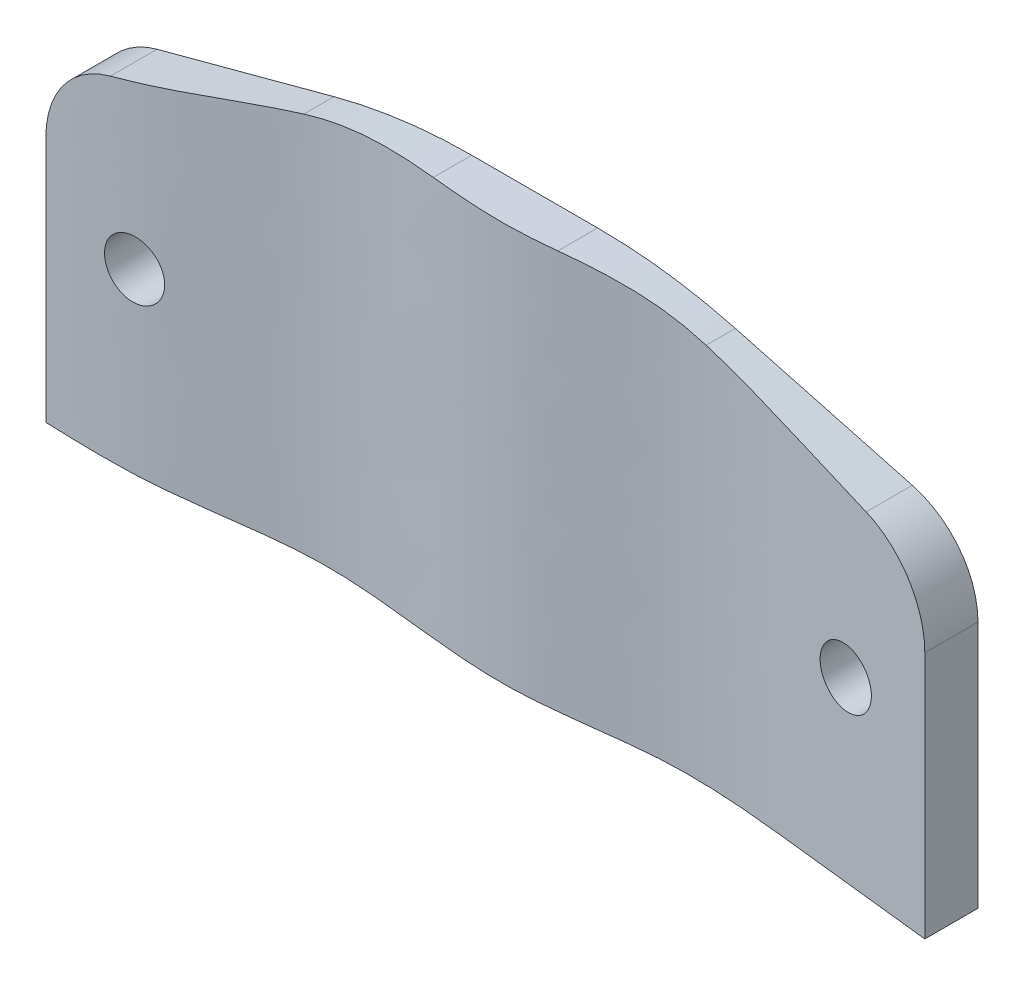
ISO-10303-21;
HEADER;
FILE_DESCRIPTION(('STEP AP214'),'2;1');
FILE_NAME('part.step','',(''),(''),'','','');
FILE_SCHEMA(('AUTOMOTIVE_DESIGN { 1 0 10303 214 1 1 1 1 }'));
ENDSEC;
DATA;
#1=APPLICATION_CONTEXT('core data for automotive mechanical design processes');
#2=APPLICATION_PROTOCOL_DEFINITION('international standard','automotive_design',2000,#1);
#3=PRODUCT_CONTEXT('',#1,'mechanical');
#4=PRODUCT('Part','Part','',(#3));
#5=PRODUCT_RELATED_PRODUCT_CATEGORY('part','',(#4));
#6=PRODUCT_DEFINITION_FORMATION('','',#4);
#7=PRODUCT_DEFINITION_CONTEXT('part definition',#1,'design');
#8=PRODUCT_DEFINITION('design','',#6,#7);
#9=PRODUCT_DEFINITION_SHAPE('','',#8);
#10=(LENGTH_UNIT() NAMED_UNIT(*) SI_UNIT(.MILLI.,.METRE.));
#11=(NAMED_UNIT(*) PLANE_ANGLE_UNIT() SI_UNIT($,.RADIAN.));
#12=(NAMED_UNIT(*) SI_UNIT($,.STERADIAN.) SOLID_ANGLE_UNIT());
#13=UNCERTAINTY_MEASURE_WITH_UNIT(LENGTH_MEASURE(1.E-05),#10,'distance_accuracy_value','');
#14=(GEOMETRIC_REPRESENTATION_CONTEXT(3) GLOBAL_UNCERTAINTY_ASSIGNED_CONTEXT((#13)) GLOBAL_UNIT_ASSIGNED_CONTEXT((#10,
#11,#12)) REPRESENTATION_CONTEXT('',''));
#15=CARTESIAN_POINT('',(0.,0.,0.));
#16=DIRECTION('',(0.,0.,1.));
#17=DIRECTION('',(1.,0.,0.));
#18=AXIS2_PLACEMENT_3D('',#15,#16,#17);
#19=CARTESIAN_POINT('',(-50.,27.948508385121,6.));
#20=DIRECTION('',(1.,0.,0.));
#21=DIRECTION('',(0.,0.,-1.));
#22=AXIS2_PLACEMENT_3D('',#19,#20,#21);
#23=PLANE('',#22);
#24=DIRECTION('',(0.,-1.,0.));
#25=VECTOR('',#24,1.);
#26=CARTESIAN_POINT('',(-50.,45.,5.11008461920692));
#27=LINE('',#26,#25);
#28=CARTESIAN_POINT('',(-50.,27.948508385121,5.11008461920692));
#29=VERTEX_POINT('',#28);
#30=CARTESIAN_POINT('',(-49.9999999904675,0.,5.11008461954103));
#31=VERTEX_POINT('',#30);
#32=EDGE_CURVE('E431',#29,#31,#27,.T.);
#33=ORIENTED_EDGE('',*,*,#32,.F.);
#34=DIRECTION('',(0.,0.,-1.));
#35=VECTOR('',#34,1.);
#36=CARTESIAN_POINT('',(-50.,27.948508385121,6.));
#37=LINE('',#36,#35);
#38=CARTESIAN_POINT('',(-50.,27.948508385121,0.));
#39=VERTEX_POINT('',#38);
#40=EDGE_CURVE('E372',#29,#39,#37,.T.);
#41=ORIENTED_EDGE('',*,*,#40,.T.);
#42=DIRECTION('',(0.,-1.,0.));
#43=VECTOR('',#42,1.);
#44=CARTESIAN_POINT('',(-50.,27.948508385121,0.));
#45=LINE('',#44,#43);
#46=CARTESIAN_POINT('',(-50.,0.,0.));
#47=VERTEX_POINT('',#46);
#48=EDGE_CURVE('E498',#39,#47,#45,.T.);
#49=ORIENTED_EDGE('',*,*,#48,.T.);
#50=DIRECTION('',(0.,0.,-1.));
#51=VECTOR('',#50,1.);
#52=CARTESIAN_POINT('',(-50.,0.,6.));
#53=LINE('',#52,#51);
#54=EDGE_CURVE('E11',#31,#47,#53,.T.);
#55=ORIENTED_EDGE('',*,*,#54,.F.);
#56=EDGE_LOOP('',(#33,#41,#49,#55));
#57=FACE_BOUND('',#56,.T.);
#58=ADVANCED_FACE('F348',(#57),#23,.F.);
#59=CARTESIAN_POINT('',(50.,0.,6.));
#60=DIRECTION('',(0.,1.,0.));
#61=DIRECTION('',(-1.,0.,0.));
#62=AXIS2_PLACEMENT_3D('',#59,#60,#61);
#63=PLANE('',#62);
#64=CARTESIAN_POINT('',(50.,0.,6.));
#65=CARTESIAN_POINT('',(45.1556419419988,0.,5.48204232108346));
#66=CARTESIAN_POINT('',(34.5204143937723,0.,4.34492617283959));
#67=CARTESIAN_POINT('',(18.5667341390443,0.,2.39851787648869));
#68=CARTESIAN_POINT('',(-0.203774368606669,0.,6.29787561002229));
#69=CARTESIAN_POINT('',(-18.9865250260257,0.,1.79013938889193));
#70=CARTESIAN_POINT('',(-36.6115833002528,0.,5.58536599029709));
#71=CARTESIAN_POINT('',(-46.5621686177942,0.,5.23221555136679));
#72=CARTESIAN_POINT('',(-50.822861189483,0.,5.08100178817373));
#73=B_SPLINE_CURVE_WITH_KNOTS('',3,(#64,#65,#66,#67,#68,#69,#70,#71,#72),.UNSPECIFIED.,.F.,.F.,
(4,1,1,1,1,1,4),(0.,0.144711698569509,0.31769778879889,0.472710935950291,0.705300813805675,
0.873814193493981,1.),.UNSPECIFIED.);
#74=CARTESIAN_POINT('',(50.,0.,6.));
#75=VERTEX_POINT('',#74);
#76=EDGE_CURVE('E425',#75,#31,#73,.T.);
#77=ORIENTED_EDGE('',*,*,#76,.T.);
#78=ORIENTED_EDGE('',*,*,#54,.T.);
#79=DIRECTION('',(1.,0.,0.));
#80=VECTOR('',#79,1.);
#81=CARTESIAN_POINT('',(50.,0.,0.));
#82=LINE('',#81,#80);
#83=CARTESIAN_POINT('',(50.,0.,0.));
#84=VERTEX_POINT('',#83);
#85=EDGE_CURVE('E439',#47,#84,#82,.T.);
#86=ORIENTED_EDGE('',*,*,#85,.T.);
#87=DIRECTION('',(0.,0.,-1.));
#88=VECTOR('',#87,1.);
#89=CARTESIAN_POINT('',(50.,0.,6.));
#90=LINE('',#89,#88);
#91=EDGE_CURVE('E356',#75,#84,#90,.T.);
#92=ORIENTED_EDGE('',*,*,#91,.F.);
#93=EDGE_LOOP('',(#77,#78,#86,#92));
#94=FACE_BOUND('',#93,.T.);
#95=ADVANCED_FACE('F437',(#94),#63,.F.);
#96=CARTESIAN_POINT('',(40.,27.9485083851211,6.));
#97=DIRECTION('',(0.,0.,-1.));
#98=DIRECTION('',(-1.,0.,0.));
#99=AXIS2_PLACEMENT_3D('',#96,#97,#98);
#100=CYLINDRICAL_SURFACE('',#99,10.);
#101=CARTESIAN_POINT('',(50.,27.948508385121,6.));
#102=CARTESIAN_POINT('',(50.0000310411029,28.2285690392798,6.00000330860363));
#103=CARTESIAN_POINT('',(49.9882362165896,28.5086247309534,5.99874221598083));
#104=CARTESIAN_POINT('',(49.9412193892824,29.066724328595,5.99371519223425));
#105=CARTESIAN_POINT('',(49.9059987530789,29.3447683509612,5.98994940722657));
#106=CARTESIAN_POINT('',(49.8123841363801,29.8967029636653,5.97994009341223));
#107=CARTESIAN_POINT('',(49.7540046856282,30.1705960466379,5.97369811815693));
#108=CARTESIAN_POINT('',(49.6145115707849,30.7124590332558,5.95878309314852));
#109=CARTESIAN_POINT('',(49.5333981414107,30.9804289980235,5.95011006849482));
#110=CARTESIAN_POINT('',(49.3489956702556,31.5086438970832,5.93039191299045));
#111=CARTESIAN_POINT('',(49.2456987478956,31.7688860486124,5.91934593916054));
#112=CARTESIAN_POINT('',(49.017699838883,32.2797116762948,5.89496271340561));
#113=CARTESIAN_POINT('',(48.8929974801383,32.530294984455,5.88162542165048));
#114=CARTESIAN_POINT('',(48.623136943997,33.0199613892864,5.85275834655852));
#115=CARTESIAN_POINT('',(48.4779849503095,33.2590479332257,5.83722922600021));
#116=CARTESIAN_POINT('',(48.1682488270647,33.7241269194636,5.80408375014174));
#117=CARTESIAN_POINT('',(48.0036648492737,33.9501194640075,5.78646741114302));
#118=CARTESIAN_POINT('',(47.6558468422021,34.3879460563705,5.74922508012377));
#119=CARTESIAN_POINT('',(47.4725705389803,34.599746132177,5.72959453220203));
#120=CARTESIAN_POINT('',(47.0889201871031,35.0072300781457,5.68848170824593));
#121=CARTESIAN_POINT('',(46.8885386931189,35.202906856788,5.66699862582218));
#122=CARTESIAN_POINT('',(46.4721279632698,35.5767369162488,5.62232563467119));
#123=CARTESIAN_POINT('',(46.2560944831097,35.7548854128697,5.59913526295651));
#124=CARTESIAN_POINT('',(45.8100661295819,36.0922965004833,5.55121591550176));
#125=CARTESIAN_POINT('',(45.5800779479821,36.2515680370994,5.52648767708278));
#126=CARTESIAN_POINT('',(45.1309554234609,36.5355203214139,5.47814846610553));
#127=CARTESIAN_POINT('',(44.9129809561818,36.6620627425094,5.45466709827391));
#128=CARTESIAN_POINT('',(44.4682006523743,36.8982898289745,5.4067004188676));
#129=CARTESIAN_POINT('',(44.2413954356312,37.007975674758,5.38221517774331));
#130=CARTESIAN_POINT('',(43.780371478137,37.2098286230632,5.33238080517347));
#131=CARTESIAN_POINT('',(43.5461571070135,37.302005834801,5.30703218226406));
#132=CARTESIAN_POINT('',(43.0715038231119,37.4684463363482,5.25558634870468));
#133=CARTESIAN_POINT('',(42.8310643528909,37.5427080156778,5.22948907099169));
#134=CARTESIAN_POINT('',(42.5881904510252,37.6077666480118,5.20308412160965));
#135=B_SPLINE_CURVE_WITH_KNOTS('',3,(#101,#102,#103,#104,#105,#106,#107,#108,#109,#110,#111,
#112,#113,#114,#115,#116,#117,#118,#119,#120,#121,#122,#123,#124,#125,#126,#127,#128,#129,#130,
#131,#132,#133,#134),.UNSPECIFIED.,.F.,.F.,(4,2,2,2,2,2,2,2,2,2,2,2,2,2,2,2,4),(0.,
0.839923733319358,1.67979847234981,2.51914710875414,3.3584870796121,4.19812571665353,
5.03777895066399,5.87717882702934,6.71657214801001,7.55790777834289,8.39961150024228,
9.24154432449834,10.0830765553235,10.8417770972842,11.6004244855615,12.3586325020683,
13.1169086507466),.UNSPECIFIED.);
#136=CARTESIAN_POINT('',(50.,27.9485083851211,6.));
#137=VERTEX_POINT('',#136);
#138=CARTESIAN_POINT('',(42.5881904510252,37.6077666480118,5.20308412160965));
#139=VERTEX_POINT('',#138);
#140=EDGE_CURVE('E506',#137,#139,#135,.T.);
#141=ORIENTED_EDGE('',*,*,#140,.F.);
#142=DIRECTION('',(0.,0.,-1.));
#143=VECTOR('',#142,1.);
#144=CARTESIAN_POINT('',(50.,27.948508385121,6.));
#145=LINE('',#144,#143);
#146=CARTESIAN_POINT('',(50.,27.948508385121,0.));
#147=VERTEX_POINT('',#146);
#148=EDGE_CURVE('E442',#137,#147,#145,.T.);
#149=ORIENTED_EDGE('',*,*,#148,.T.);
#150=CARTESIAN_POINT('',(40.,27.9485083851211,0.));
#151=DIRECTION('',(0.,0.,1.));
#152=DIRECTION('',(1.,0.,0.));
#153=AXIS2_PLACEMENT_3D('',#150,#151,#152);
#154=CIRCLE('',#153,10.);
#155=CARTESIAN_POINT('',(42.5881904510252,37.6077666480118,0.));
#156=VERTEX_POINT('',#155);
#157=EDGE_CURVE('E493',#147,#156,#154,.T.);
#158=ORIENTED_EDGE('',*,*,#157,.T.);
#159=DIRECTION('',(0.,0.,-1.));
#160=VECTOR('',#159,1.);
#161=CARTESIAN_POINT('',(42.5881904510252,37.6077666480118,6.));
#162=LINE('',#161,#160);
#163=EDGE_CURVE('E461',#139,#156,#162,.T.);
#164=ORIENTED_EDGE('',*,*,#163,.F.);
#165=EDGE_LOOP('',(#141,#149,#158,#164));
#166=FACE_BOUND('',#165,.T.);
#167=ADVANCED_FACE('F514',(#166),#100,.T.);
#168=CARTESIAN_POINT('',(22.6299928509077,42.955549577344,6.));
#169=DIRECTION('',(-0.258819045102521,-0.965925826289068,0.));
#170=DIRECTION('',(0.965925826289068,-0.258819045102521,0.));
#171=AXIS2_PLACEMENT_3D('',#168,#169,#170);
#172=PLANE('',#171);
#173=CARTESIAN_POINT('',(42.5881904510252,37.6077666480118,5.20308412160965));
#174=CARTESIAN_POINT('',(41.9235272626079,37.7858626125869,5.13082355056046));
#175=CARTESIAN_POINT('',(41.2588961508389,37.96394998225,5.05824429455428));
#176=CARTESIAN_POINT('',(39.9297795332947,38.3200857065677,4.91228864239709));
#177=CARTESIAN_POINT('',(39.2652940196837,38.498134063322,4.83891232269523));
#178=CARTESIAN_POINT('',(38.2686723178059,38.7651780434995,4.72812335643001));
#179=CARTESIAN_POINT('',(37.9364983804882,38.8541837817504,4.69107470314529));
#180=CARTESIAN_POINT('',(37.2721782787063,39.0321878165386,4.61671206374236));
#181=CARTESIAN_POINT('',(36.9400321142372,39.1211861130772,4.57939807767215));
#182=CARTESIAN_POINT('',(36.275799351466,39.2991667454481,4.50449580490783));
#183=CARTESIAN_POINT('',(35.9437127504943,39.3881490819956,4.46690754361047));
#184=CARTESIAN_POINT('',(35.2795744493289,39.5661044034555,4.39140163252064));
#185=CARTESIAN_POINT('',(34.9475227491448,39.6550773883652,4.35348398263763));
#186=CARTESIAN_POINT('',(34.2834496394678,39.8330152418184,4.27765864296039));
#187=CARTESIAN_POINT('',(33.9514282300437,39.9219801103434,4.23975095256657));
#188=CARTESIAN_POINT('',(33.2873423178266,40.0999213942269,4.16434341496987));
#189=CARTESIAN_POINT('',(32.9552778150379,40.1888978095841,4.12684356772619));
#190=CARTESIAN_POINT('',(31.9587095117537,40.4559274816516,4.01550376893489));
#191=CARTESIAN_POINT('',(31.2940800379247,40.63401441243,3.94285259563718));
#192=CARTESIAN_POINT('',(29.9642753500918,40.9903345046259,3.80384267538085));
#193=CARTESIAN_POINT('',(29.2991002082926,41.1685676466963,3.73748319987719));
#194=CARTESIAN_POINT('',(27.967966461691,41.525243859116,3.61419442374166));
#195=CARTESIAN_POINT('',(27.3020079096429,41.7036869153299,3.55726452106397));
#196=CARTESIAN_POINT('',(25.9690509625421,42.060851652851,3.45600892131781));
#197=CARTESIAN_POINT('',(25.3020524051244,42.2395733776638,3.41168544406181));
#198=CARTESIAN_POINT('',(23.9668119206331,42.5973499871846,3.33888047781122));
#199=CARTESIAN_POINT('',(23.2985694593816,42.7764050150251,3.31040964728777));
#200=CARTESIAN_POINT('',(22.6299928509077,42.955549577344,3.29151039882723));
#201=B_SPLINE_CURVE_WITH_KNOTS('',3,(#173,#174,#175,#176,#177,#178,#179,#180,#181,#182,#183,
#184,#185,#186,#187,#188,#189,#190,#191,#192,#193,#194,#195,#196,#197,#198,#199,#200),
.UNSPECIFIED.,.F.,.F.,(4,2,2,2,2,2,2,2,2,2,2,2,2,4),(0.,2.07568148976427,4.15116562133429,
5.18881061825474,6.22645542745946,7.26400534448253,8.30155554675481,9.33900880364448,
10.3764619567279,12.4521468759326,14.5275911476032,16.6029028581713,18.6785797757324,
20.7556505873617),.UNSPECIFIED.);
#202=CARTESIAN_POINT('',(22.6299928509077,42.955549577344,3.29151039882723));
#203=VERTEX_POINT('',#202);
#204=EDGE_CURVE('E583',#139,#203,#201,.T.);
#205=ORIENTED_EDGE('',*,*,#204,.F.);
#206=ORIENTED_EDGE('',*,*,#163,.T.);
#207=DIRECTION('',(-0.965925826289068,0.258819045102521,0.));
#208=VECTOR('',#207,1.);
#209=CARTESIAN_POINT('',(22.6299928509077,42.955549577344,0.));
#210=LINE('',#209,#208);
#211=CARTESIAN_POINT('',(22.6299928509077,42.955549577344,0.));
#212=VERTEX_POINT('',#211);
#213=EDGE_CURVE('E491',#156,#212,#210,.T.);
#214=ORIENTED_EDGE('',*,*,#213,.T.);
#215=DIRECTION('',(0.,0.,-1.));
#216=VECTOR('',#215,1.);
#217=CARTESIAN_POINT('',(22.6299928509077,42.955549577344,6.));
#218=LINE('',#217,#216);
#219=EDGE_CURVE('E465',#203,#212,#218,.T.);
#220=ORIENTED_EDGE('',*,*,#219,.F.);
#221=EDGE_LOOP('',(#205,#206,#214,#220));
#222=FACE_BOUND('',#221,.T.);
#223=ADVANCED_FACE('F591',(#222),#172,.F.);
#224=CARTESIAN_POINT('',(7.10085014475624,-15.,6.));
#225=DIRECTION('',(0.,0.,-1.));
#226=DIRECTION('',(-1.,0.,0.));
#227=AXIS2_PLACEMENT_3D('',#224,#225,#226);
#228=CYLINDRICAL_SURFACE('',#227,60.);
#229=CARTESIAN_POINT('',(22.6299928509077,42.955549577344,3.29151039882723));
#230=CARTESIAN_POINT('',(22.2041215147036,43.0696658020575,3.2794748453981));
#231=CARTESIAN_POINT('',(21.7768543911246,43.1791163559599,3.27129152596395));
#232=CARTESIAN_POINT('',(20.9215550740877,43.3881928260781,3.26364637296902));
#233=CARTESIAN_POINT('',(20.4935318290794,43.4878542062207,3.26415179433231));
#234=CARTESIAN_POINT('',(19.8506528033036,43.6301162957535,3.27212686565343));
#235=CARTESIAN_POINT('',(19.6365311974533,43.6762700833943,3.27597722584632));
#236=CARTESIAN_POINT('',(19.2078514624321,43.7662188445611,3.28619690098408));
#237=CARTESIAN_POINT('',(18.9932933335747,43.8100138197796,3.29256621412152));
#238=CARTESIAN_POINT('',(18.5642192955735,43.895151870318,3.3079214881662));
#239=CARTESIAN_POINT('',(18.3497041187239,43.9364995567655,3.31690232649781));
#240=CARTESIAN_POINT('',(17.9203649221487,44.0168263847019,3.33763767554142));
#241=CARTESIAN_POINT('',(17.7055409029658,44.055805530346,3.34939218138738));
#242=CARTESIAN_POINT('',(17.2758346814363,44.1313557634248,3.37549815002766));
#243=CARTESIAN_POINT('',(17.0609527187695,44.1679290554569,3.38984718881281));
#244=CARTESIAN_POINT('',(16.6309698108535,44.2387060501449,3.42089398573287));
#245=CARTESIAN_POINT('',(16.4158688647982,44.2729097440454,3.4375917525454));
#246=CARTESIAN_POINT('',(15.770347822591,44.3719575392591,3.49084885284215));
#247=CARTESIAN_POINT('',(15.3396376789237,44.4332509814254,3.53057651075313));
#248=CARTESIAN_POINT('',(14.478272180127,44.546301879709,3.61646093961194));
#249=CARTESIAN_POINT('',(14.0476176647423,44.5980731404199,3.66260823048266));
#250=CARTESIAN_POINT('',(13.1853772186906,44.6922674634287,3.75945836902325));
#251=CARTESIAN_POINT('',(12.7537907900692,44.7346814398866,3.81016557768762));
#252=CARTESIAN_POINT('',(11.8894585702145,44.8101806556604,3.91419067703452));
#253=CARTESIAN_POINT('',(11.4567120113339,44.8432517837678,3.96751237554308));
#254=CARTESIAN_POINT('',(10.5898233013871,44.9000510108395,4.07479453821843));
#255=CARTESIAN_POINT('',(10.1556800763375,44.9237607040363,4.12875604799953));
#256=CARTESIAN_POINT('',(9.28575222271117,44.9617897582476,4.23531064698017));
#257=CARTESIAN_POINT('',(8.84996615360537,44.9760864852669,4.28790014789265));
#258=CARTESIAN_POINT('',(7.97651186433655,44.9952040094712,4.38965165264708));
#259=CARTESIAN_POINT('',(7.5388418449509,44.9999972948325,4.43880330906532));
#260=CARTESIAN_POINT('',(7.10085014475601,45.,4.48511280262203));
#261=B_SPLINE_CURVE_WITH_KNOTS('',3,(#229,#230,#231,#232,#233,#234,#235,#236,#237,#238,#239,
#240,#241,#242,#243,#244,#245,#246,#247,#248,#249,#250,#251,#252,#253,#254,#255,#256,#257,#258,
#259,#260),.UNSPECIFIED.,.F.,.F.,(4,2,2,2,2,2,2,2,2,2,2,2,2,2,2,4),(0.,1.32319585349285,
2.64140610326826,3.29860192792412,3.95579728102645,4.611712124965,5.26762581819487,
5.92292984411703,6.57823629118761,7.88863001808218,9.19710879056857,10.5068525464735,
11.8185640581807,13.1328418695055,14.4502685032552,15.7715034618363),.UNSPECIFIED.);
#262=CARTESIAN_POINT('',(7.10085014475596,45.,4.48511280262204));
#263=VERTEX_POINT('',#262);
#264=EDGE_CURVE('E578',#203,#263,#261,.T.);
#265=ORIENTED_EDGE('',*,*,#264,.F.);
#266=ORIENTED_EDGE('',*,*,#219,.T.);
#267=CARTESIAN_POINT('',(7.10085014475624,-15.,0.));
#268=DIRECTION('',(0.,0.,1.));
#269=DIRECTION('',(1.,0.,0.));
#270=AXIS2_PLACEMENT_3D('',#267,#268,#269);
#271=CIRCLE('',#270,60.);
#272=CARTESIAN_POINT('',(7.100850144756,45.,0.));
#273=VERTEX_POINT('',#272);
#274=EDGE_CURVE('E488',#212,#273,#271,.T.);
#275=ORIENTED_EDGE('',*,*,#274,.T.);
#276=DIRECTION('',(0.,0.,-1.));
#277=VECTOR('',#276,1.);
#278=CARTESIAN_POINT('',(7.100850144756,45.,6.));
#279=LINE('',#278,#277);
#280=EDGE_CURVE('E471',#263,#273,#279,.T.);
#281=ORIENTED_EDGE('',*,*,#280,.F.);
#282=EDGE_LOOP('',(#265,#266,#275,#281));
#283=FACE_BOUND('',#282,.T.);
#284=ADVANCED_FACE('F587',(#283),#228,.T.);
#285=CARTESIAN_POINT('',(-7.10085014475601,45.,6.));
#286=DIRECTION('',(0.,-1.,0.));
#287=DIRECTION('',(1.,0.,0.));
#288=AXIS2_PLACEMENT_3D('',#285,#286,#287);
#289=PLANE('',#288);
#290=CARTESIAN_POINT('',(50.,45.,6.));
#291=CARTESIAN_POINT('',(45.1556419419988,45.,5.48204232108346));
#292=CARTESIAN_POINT('',(34.5204143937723,45.,4.34492617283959));
#293=CARTESIAN_POINT('',(18.5667341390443,45.,2.39851787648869));
#294=CARTESIAN_POINT('',(-0.203774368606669,45.,6.29787561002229));
#295=CARTESIAN_POINT('',(-18.9865250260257,45.,1.79013938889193));
#296=CARTESIAN_POINT('',(-36.6115833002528,45.,5.58536599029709));
#297=CARTESIAN_POINT('',(-46.5621686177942,45.,5.23221555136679));
#298=CARTESIAN_POINT('',(-50.822861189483,45.,5.08100178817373));
#299=B_SPLINE_CURVE_WITH_KNOTS('',3,(#290,#291,#292,#293,#294,#295,#296,#297,#298),
.UNSPECIFIED.,.F.,.F.,(4,1,1,1,1,1,4),(0.,0.144711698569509,0.31769778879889,0.472710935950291,
0.705300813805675,0.873814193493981,1.),.UNSPECIFIED.);
#300=CARTESIAN_POINT('',(-7.10085014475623,45.,4.33370743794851));
#301=VERTEX_POINT('',#300);
#302=EDGE_CURVE('E434',#263,#301,#299,.T.);
#303=ORIENTED_EDGE('',*,*,#302,.F.);
#304=ORIENTED_EDGE('',*,*,#280,.T.);
#305=DIRECTION('',(-1.,0.,0.));
#306=VECTOR('',#305,1.);
#307=CARTESIAN_POINT('',(-7.10085014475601,45.,0.));
#308=LINE('',#307,#306);
#309=CARTESIAN_POINT('',(-7.10085014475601,45.,0.));
#310=VERTEX_POINT('',#309);
#311=EDGE_CURVE('E485',#273,#310,#308,.T.);
#312=ORIENTED_EDGE('',*,*,#311,.T.);
#313=DIRECTION('',(0.,0.,-1.));
#314=VECTOR('',#313,1.);
#315=CARTESIAN_POINT('',(-7.10085014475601,45.,6.));
#316=LINE('',#315,#314);
#317=EDGE_CURVE('E475',#301,#310,#316,.T.);
#318=ORIENTED_EDGE('',*,*,#317,.F.);
#319=EDGE_LOOP('',(#303,#304,#312,#318));
#320=FACE_BOUND('',#319,.T.);
#321=ADVANCED_FACE('F590',(#320),#289,.F.);
#322=CARTESIAN_POINT('',(-7.1008501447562,-15.,6.));
#323=DIRECTION('',(0.,0.,-1.));
#324=DIRECTION('',(-1.,0.,0.));
#325=AXIS2_PLACEMENT_3D('',#322,#323,#324);
#326=CYLINDRICAL_SURFACE('',#325,60.);
#327=CARTESIAN_POINT('',(-7.10085014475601,45.,4.33370743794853));
#328=CARTESIAN_POINT('',(-7.53851996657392,44.9999984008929,4.28893230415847));
#329=CARTESIAN_POINT('',(-7.9760521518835,44.9952110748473,4.24286191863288));
#330=CARTESIAN_POINT('',(-8.84953047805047,44.9760990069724,4.14971797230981));
#331=CARTESIAN_POINT('',(-9.28547756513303,44.9618016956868,4.10264767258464));
#332=CARTESIAN_POINT('',(-10.1559338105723,44.9237496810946,4.00893102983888));
#333=CARTESIAN_POINT('',(-10.5904438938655,44.9000179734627,3.96228393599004));
#334=CARTESIAN_POINT('',(-11.4581726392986,44.8431484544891,3.87081071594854));
#335=CARTESIAN_POINT('',(-11.8913921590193,44.8100292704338,3.82598118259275));
#336=CARTESIAN_POINT('',(-12.7566817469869,44.7344113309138,3.73951830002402));
#337=CARTESIAN_POINT('',(-13.1887525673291,44.6919265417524,3.69788031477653));
#338=CARTESIAN_POINT('',(-14.0518833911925,44.5975791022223,3.61915855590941));
#339=CARTESIAN_POINT('',(-14.4829439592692,44.5457251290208,3.58207062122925));
#340=CARTESIAN_POINT('',(-15.3448384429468,44.4325315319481,3.51374366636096));
#341=CARTESIAN_POINT('',(-15.7756714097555,44.3711801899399,3.48251197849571));
#342=CARTESIAN_POINT('',(-16.6364844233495,44.2390188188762,3.42731772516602));
#343=CARTESIAN_POINT('',(-17.0664641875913,44.1682060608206,3.40335726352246));
#344=CARTESIAN_POINT('',(-17.9256015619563,44.0170751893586,3.36404590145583));
#345=CARTESIAN_POINT('',(-18.354757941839,43.9367477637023,3.34870352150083));
#346=CARTESIAN_POINT('',(-18.9976641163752,43.8091292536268,3.33314568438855));
#347=CARTESIAN_POINT('',(-19.2120313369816,43.7653568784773,3.32920216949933));
#348=CARTESIAN_POINT('',(-19.6403067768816,43.6754624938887,3.32397356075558));
#349=CARTESIAN_POINT('',(-19.8542149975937,43.6293404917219,3.32268845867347));
#350=CARTESIAN_POINT('',(-20.2821465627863,43.5346187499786,3.32292386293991));
#351=CARTESIAN_POINT('',(-20.4961683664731,43.4860120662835,3.32445270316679));
#352=CARTESIAN_POINT('',(-20.9236268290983,43.3864624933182,3.33051500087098));
#353=CARTESIAN_POINT('',(-21.1370634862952,43.3355195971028,3.33504846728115));
#354=CARTESIAN_POINT('',(-21.5641700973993,43.2310991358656,3.34715080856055));
#355=CARTESIAN_POINT('',(-21.7778373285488,43.1776119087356,3.35473223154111));
#356=CARTESIAN_POINT('',(-22.2044610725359,43.0683169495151,3.37266935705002));
#357=CARTESIAN_POINT('',(-22.4174175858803,43.01250921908,3.38302505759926));
#358=CARTESIAN_POINT('',(-22.6299928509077,42.955549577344,3.39463734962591));
#359=B_SPLINE_CURVE_WITH_KNOTS('',3,(#327,#328,#329,#330,#331,#332,#333,#334,#335,#336,#337,
#338,#339,#340,#341,#342,#343,#344,#345,#346,#347,#348,#349,#350,#351,#352,#353,#354,#355,#356,
#357,#358),.UNSPECIFIED.,.F.,.F.,(4,2,2,2,2,2,2,2,2,2,2,2,2,2,2,4),(0.,1.31982806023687,
2.63586562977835,3.94871492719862,5.25897719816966,6.56729862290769,7.87441451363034,
9.18315620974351,10.49227621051,11.8026882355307,12.4591425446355,13.1155948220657,
13.7739944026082,14.4323959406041,15.0935362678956,15.7546761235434),.UNSPECIFIED.);
#360=CARTESIAN_POINT('',(-22.6299928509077,42.955549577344,3.39463734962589));
#361=VERTEX_POINT('',#360);
#362=EDGE_CURVE('E572',#301,#361,#359,.T.);
#363=ORIENTED_EDGE('',*,*,#362,.F.);
#364=ORIENTED_EDGE('',*,*,#317,.T.);
#365=CARTESIAN_POINT('',(-7.1008501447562,-15.,0.));
#366=DIRECTION('',(0.,0.,1.));
#367=DIRECTION('',(1.,0.,0.));
#368=AXIS2_PLACEMENT_3D('',#365,#366,#367);
#369=CIRCLE('',#368,60.);
#370=CARTESIAN_POINT('',(-22.6299928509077,42.955549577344,0.));
#371=VERTEX_POINT('',#370);
#372=EDGE_CURVE('E482',#310,#371,#369,.T.);
#373=ORIENTED_EDGE('',*,*,#372,.T.);
#374=DIRECTION('',(0.,0.,-1.));
#375=VECTOR('',#374,1.);
#376=CARTESIAN_POINT('',(-22.6299928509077,42.955549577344,6.));
#377=LINE('',#376,#375);
#378=EDGE_CURVE('E477',#361,#371,#377,.T.);
#379=ORIENTED_EDGE('',*,*,#378,.F.);
#380=EDGE_LOOP('',(#363,#364,#373,#379));
#381=FACE_BOUND('',#380,.T.);
#382=ADVANCED_FACE('F564',(#381),#326,.T.);
#383=CARTESIAN_POINT('',(-22.6299928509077,42.955549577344,6.));
#384=DIRECTION('',(0.258819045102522,-0.965925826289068,0.));
#385=DIRECTION('',(0.965925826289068,0.258819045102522,0.));
#386=AXIS2_PLACEMENT_3D('',#383,#384,#385);
#387=PLANE('',#386);
#388=CARTESIAN_POINT('',(-22.6299928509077,42.955549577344,3.39463734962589));
#389=CARTESIAN_POINT('',(-23.2978724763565,42.7765917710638,3.43116362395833));
#390=CARTESIAN_POINT('',(-23.9649101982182,42.5978595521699,3.48038249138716));
#391=CARTESIAN_POINT('',(-25.2969300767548,42.2409459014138,3.59786240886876));
#392=CARTESIAN_POINT('',(-25.961913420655,42.0627641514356,3.66610876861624));
#393=CARTESIAN_POINT('',(-27.2903965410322,41.7067981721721,3.81536684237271));
#394=CARTESIAN_POINT('',(-27.953896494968,41.529013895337,3.8963769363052));
#395=CARTESIAN_POINT('',(-29.2801052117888,41.1736573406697,4.06503469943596));
#396=CARTESIAN_POINT('',(-29.9428139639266,40.9960850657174,4.15268245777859));
#397=CARTESIAN_POINT('',(-31.2680858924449,40.6409795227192,4.32854850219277));
#398=CARTESIAN_POINT('',(-31.9306490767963,40.4634462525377,4.4167667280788));
#399=CARTESIAN_POINT('',(-33.2570349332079,40.1080422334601,4.58782517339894));
#400=CARTESIAN_POINT('',(-33.9208582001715,39.9301713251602,4.67066061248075));
#401=CARTESIAN_POINT('',(-34.9173726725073,39.6631560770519,4.78621923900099));
#402=CARTESIAN_POINT('',(-35.2495906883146,39.5741385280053,4.82328148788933));
#403=CARTESIAN_POINT('',(-35.9143908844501,39.3960058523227,4.89374641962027));
#404=CARTESIAN_POINT('',(-36.2469730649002,39.3068907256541,4.92714910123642));
#405=CARTESIAN_POINT('',(-36.9124358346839,39.1285805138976,4.98951156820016));
#406=CARTESIAN_POINT('',(-37.2453163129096,39.039385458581,5.01847260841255));
#407=CARTESIAN_POINT('',(-37.7449231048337,38.9055162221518,5.05800304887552));
#408=CARTESIAN_POINT('',(-37.9115059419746,38.860880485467,5.07052798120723));
#409=CARTESIAN_POINT('',(-38.2447641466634,38.7715842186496,5.09418013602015));
#410=CARTESIAN_POINT('',(-38.4114395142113,38.726923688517,5.10530735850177));
#411=CARTESIAN_POINT('',(-38.9117338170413,38.5928702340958,5.13668671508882));
#412=CARTESIAN_POINT('',(-39.245472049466,38.5034453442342,5.15492479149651));
#413=CARTESIAN_POINT('',(-39.9131721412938,38.3245356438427,5.18646302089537));
#414=CARTESIAN_POINT('',(-40.2471340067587,38.2350508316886,5.19976303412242));
#415=CARTESIAN_POINT('',(-40.9155825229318,38.0559405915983,5.22187720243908));
#416=CARTESIAN_POINT('',(-41.2500693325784,37.9663151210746,5.23068612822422));
#417=CARTESIAN_POINT('',(-41.9190978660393,37.7870494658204,5.24423824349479));
#418=CARTESIAN_POINT('',(-42.2536395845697,37.6974092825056,5.24898170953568));
#419=CARTESIAN_POINT('',(-42.5881904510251,37.6077666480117,5.25191470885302));
#420=B_SPLINE_CURVE_WITH_KNOTS('',3,(#388,#389,#390,#391,#392,#393,#394,#395,#396,#397,#398,
#399,#400,#401,#402,#403,#404,#405,#406,#407,#408,#409,#410,#411,#412,#413,#414,#415,#416,#417,
#418,#419),.UNSPECIFIED.,.F.,.F.,(4,2,2,2,2,2,2,2,2,2,2,2,2,2,2,4),(0.,2.07681152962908,
4.15202406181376,6.22697340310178,8.30195061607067,10.3767123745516,12.4532921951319,
13.4910617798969,14.5288317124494,15.5663079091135,16.0850432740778,16.6037786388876,
17.6417131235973,18.6796769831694,19.7188466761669,20.7579456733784),.UNSPECIFIED.);
#421=CARTESIAN_POINT('',(-42.5881904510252,37.6077666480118,5.25191470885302));
#422=VERTEX_POINT('',#421);
#423=EDGE_CURVE('E364',#361,#422,#420,.T.);
#424=ORIENTED_EDGE('',*,*,#423,.F.);
#425=ORIENTED_EDGE('',*,*,#378,.T.);
#426=DIRECTION('',(-0.965925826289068,-0.258819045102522,0.));
#427=VECTOR('',#426,1.);
#428=CARTESIAN_POINT('',(-22.6299928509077,42.955549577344,0.));
#429=LINE('',#428,#427);
#430=CARTESIAN_POINT('',(-42.5881904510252,37.6077666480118,0.));
#431=VERTEX_POINT('',#430);
#432=EDGE_CURVE('E451',#371,#431,#429,.T.);
#433=ORIENTED_EDGE('',*,*,#432,.T.);
#434=DIRECTION('',(0.,0.,-1.));
#435=VECTOR('',#434,1.);
#436=CARTESIAN_POINT('',(-42.5881904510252,37.6077666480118,6.));
#437=LINE('',#436,#435);
#438=EDGE_CURVE('E449',#422,#431,#437,.T.);
#439=ORIENTED_EDGE('',*,*,#438,.F.);
#440=EDGE_LOOP('',(#424,#425,#433,#439));
#441=FACE_BOUND('',#440,.T.);
#442=ADVANCED_FACE('F559',(#441),#387,.F.);
#443=CARTESIAN_POINT('',(-40.,27.9485083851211,6.));
#444=DIRECTION('',(0.,0.,-1.));
#445=DIRECTION('',(-1.,0.,0.));
#446=AXIS2_PLACEMENT_3D('',#443,#444,#445);
#447=CYLINDRICAL_SURFACE('',#446,10.);
#448=CARTESIAN_POINT('',(-42.5881904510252,37.6077666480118,5.25191470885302));
#449=CARTESIAN_POINT('',(-42.8594794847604,37.5351069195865,5.2542954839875));
#450=CARTESIAN_POINT('',(-43.1276931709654,37.4509597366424,5.25545429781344));
#451=CARTESIAN_POINT('',(-43.6560813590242,37.2604239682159,5.255733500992));
#452=CARTESIAN_POINT('',(-43.9162564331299,37.154036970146,5.2548540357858));
#453=CARTESIAN_POINT('',(-44.4265770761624,36.9198092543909,5.25146334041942));
#454=CARTESIAN_POINT('',(-44.6767281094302,36.7919804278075,5.24895301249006));
#455=CARTESIAN_POINT('',(-45.1653809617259,36.515748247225,5.24270337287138));
#456=CARTESIAN_POINT('',(-45.4038828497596,36.3673450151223,5.23896406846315));
#457=CARTESIAN_POINT('',(-45.8676237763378,36.0509652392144,5.23063510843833));
#458=CARTESIAN_POINT('',(-46.0928586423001,35.8829825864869,5.22604518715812));
#459=CARTESIAN_POINT('',(-46.5283965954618,35.5286697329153,5.2163635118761));
#460=CARTESIAN_POINT('',(-46.7386994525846,35.342339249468,5.21127175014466));
#461=CARTESIAN_POINT('',(-47.1428243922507,34.9527084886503,5.20089505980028));
#462=CARTESIAN_POINT('',(-47.3366512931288,34.7494132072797,5.19561018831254));
#463=CARTESIAN_POINT('',(-47.7065221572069,34.3272443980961,5.18510768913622));
#464=CARTESIAN_POINT('',(-47.8825662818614,34.1083710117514,5.17989006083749));
#465=CARTESIAN_POINT('',(-48.2158867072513,33.6562407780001,5.16972971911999));
#466=CARTESIAN_POINT('',(-48.3731334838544,33.4229621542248,5.16478744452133));
#467=CARTESIAN_POINT('',(-48.6674893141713,32.9438767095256,5.15535638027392));
#468=CARTESIAN_POINT('',(-48.8045894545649,32.6980644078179,5.15086779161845));
#469=CARTESIAN_POINT('',(-49.0576151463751,32.1957099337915,5.14247708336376));
#470=CARTESIAN_POINT('',(-49.1735368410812,31.9391658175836,5.13857507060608));
#471=CARTESIAN_POINT('',(-49.3832988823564,31.4173313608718,5.13145608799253));
#472=CARTESIAN_POINT('',(-49.477150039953,31.1520453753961,5.12823878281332));
#473=CARTESIAN_POINT('',(-49.6325258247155,30.6459343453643,5.12288565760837));
#474=CARTESIAN_POINT('',(-49.6965461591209,30.4058724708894,5.12066740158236));
#475=CARTESIAN_POINT('',(-49.8065440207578,29.9216604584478,5.11684565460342));
#476=CARTESIAN_POINT('',(-49.8525231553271,29.6775106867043,5.11524210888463));
#477=CARTESIAN_POINT('',(-49.9261630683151,29.1865873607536,5.11267042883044));
#478=CARTESIAN_POINT('',(-49.9538329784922,28.9398151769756,5.11170197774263));
#479=CARTESIAN_POINT('',(-49.9907616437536,28.4448659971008,5.11040837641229));
#480=CARTESIAN_POINT('',(-50.0000181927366,28.1966888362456,5.11008330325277));
#481=CARTESIAN_POINT('',(-50.,27.948508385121,5.11008461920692));
#482=B_SPLINE_CURVE_WITH_KNOTS('',3,(#448,#449,#450,#451,#452,#453,#454,#455,#456,#457,#458,
#459,#460,#461,#462,#463,#464,#465,#466,#467,#468,#469,#470,#471,#472,#473,#474,#475,#476,#477,
#478,#479,#480,#481),.UNSPECIFIED.,.F.,.F.,(4,2,2,2,2,2,2,2,2,2,2,2,2,2,2,2,4),(0.,
0.842318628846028,1.68457715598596,2.52637012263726,3.36815810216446,4.21020943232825,
5.05227373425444,5.89409092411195,6.73590047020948,7.57901530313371,8.42250203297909,
9.26614221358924,10.109368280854,10.854080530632,11.5987264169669,12.3430006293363,
13.0873640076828),.UNSPECIFIED.);
#483=EDGE_CURVE('E541',#422,#29,#482,.T.);
#484=ORIENTED_EDGE('',*,*,#483,.F.);
#485=ORIENTED_EDGE('',*,*,#438,.T.);
#486=CARTESIAN_POINT('',(-40.,27.9485083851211,0.));
#487=DIRECTION('',(0.,0.,1.));
#488=DIRECTION('',(-1.,0.,0.));
#489=AXIS2_PLACEMENT_3D('',#486,#487,#488);
#490=CIRCLE('',#489,10.);
#491=EDGE_CURVE('E447',#431,#39,#490,.T.);
#492=ORIENTED_EDGE('',*,*,#491,.T.);
#493=ORIENTED_EDGE('',*,*,#40,.F.);
#494=EDGE_LOOP('',(#484,#485,#492,#493));
#495=FACE_BOUND('',#494,.T.);
#496=ADVANCED_FACE('F551',(#495),#447,.T.);
#497=CARTESIAN_POINT('',(40.,20.,6.));
#498=DIRECTION('',(0.,0.,-1.));
#499=DIRECTION('',(-1.,0.,0.));
#500=AXIS2_PLACEMENT_3D('',#497,#498,#499);
#501=CYLINDRICAL_SURFACE('',#500,3.25000000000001);
#502=CARTESIAN_POINT('',(40.,20.,0.));
#503=DIRECTION('',(0.,0.,1.));
#504=DIRECTION('',(1.,0.,0.));
#505=AXIS2_PLACEMENT_3D('',#502,#503,#504);
#506=CIRCLE('',#505,3.25000000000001);
#507=CARTESIAN_POINT('',(43.25,20.,0.));
#508=VERTEX_POINT('',#507);
#509=EDGE_CURVE('E500',#508,#508,#506,.T.);
#510=ORIENTED_EDGE('',*,*,#509,.F.);
#511=EDGE_LOOP('',(#510));
#512=FACE_BOUND('',#511,.T.);
#513=CARTESIAN_POINT('',(36.75,20.,4.55796116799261));
#514=CARTESIAN_POINT('',(36.7500081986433,19.8182920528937,4.5579621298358));
#515=CARTESIAN_POINT('',(36.7652917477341,19.6364518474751,4.55968406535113));
#516=CARTESIAN_POINT('',(36.8260312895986,19.2777950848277,4.56652383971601));
#517=CARTESIAN_POINT('',(36.871523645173,19.1009848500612,4.57164577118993));
#518=CARTESIAN_POINT('',(36.9913299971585,18.7576523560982,4.5851231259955));
#519=CARTESIAN_POINT('',(37.0656263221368,18.5911238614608,4.59347656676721));
#520=CARTESIAN_POINT('',(37.2408542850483,18.2729812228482,4.61315574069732));
#521=CARTESIAN_POINT('',(37.3417796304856,18.1213635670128,4.62448077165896));
#522=CARTESIAN_POINT('',(37.5676928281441,17.8367891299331,4.6497960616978));
#523=CARTESIAN_POINT('',(37.6927502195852,17.7038882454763,4.66379402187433));
#524=CARTESIAN_POINT('',(37.9631577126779,17.4609422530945,4.69401413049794));
#525=CARTESIAN_POINT('',(38.1085091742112,17.3508986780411,4.71023642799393));
#526=CARTESIAN_POINT('',(38.4162931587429,17.1561055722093,4.74452978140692));
#527=CARTESIAN_POINT('',(38.5788213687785,17.0715090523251,4.76261117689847));
#528=CARTESIAN_POINT('',(38.9156394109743,16.9308019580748,4.80001723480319));
#529=CARTESIAN_POINT('',(39.0899295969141,16.874692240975,4.81934193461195));
#530=CARTESIAN_POINT('',(39.4463336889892,16.7922614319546,4.85879037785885));
#531=CARTESIAN_POINT('',(39.628484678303,16.766102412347,4.87891786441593));
#532=CARTESIAN_POINT('',(39.9945772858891,16.7448361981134,4.91930295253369));
#533=CARTESIAN_POINT('',(40.1785189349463,16.7497295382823,4.93956055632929));
#534=CARTESIAN_POINT('',(40.5434592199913,16.7904912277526,4.97968894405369));
#535=CARTESIAN_POINT('',(40.7244492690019,16.8264376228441,4.99955862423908));
#536=CARTESIAN_POINT('',(41.0778553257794,16.9284284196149,5.03830196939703));
#537=CARTESIAN_POINT('',(41.2502713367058,16.994472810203,5.0571756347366));
#538=CARTESIAN_POINT('',(41.5813630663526,17.1547283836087,5.09337430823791));
#539=CARTESIAN_POINT('',(41.7400570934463,17.2489012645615,5.11070138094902));
#540=CARTESIAN_POINT('',(42.0393850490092,17.4628270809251,5.14334995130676));
#541=CARTESIAN_POINT('',(42.1800193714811,17.5825794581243,5.15867149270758));
#542=CARTESIAN_POINT('',(42.4385337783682,17.8436947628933,5.18681237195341));
#543=CARTESIAN_POINT('',(42.5565147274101,17.984956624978,5.19964280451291));
#544=CARTESIAN_POINT('',(42.7670634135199,18.2854970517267,5.22252588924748));
#545=CARTESIAN_POINT('',(42.8596319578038,18.4447750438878,5.23257862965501));
#546=CARTESIAN_POINT('',(43.0161679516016,18.7758407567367,5.24957107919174));
#547=CARTESIAN_POINT('',(43.0802970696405,18.94755113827,5.25652838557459));
#548=CARTESIAN_POINT('',(43.1788396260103,19.2993921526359,5.26721687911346));
#549=CARTESIAN_POINT('',(43.2132539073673,19.4795225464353,5.27094815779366));
#550=CARTESIAN_POINT('',(43.2512625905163,19.8422244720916,5.27506905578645));
#551=CARTESIAN_POINT('',(43.2549944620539,20.0247814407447,5.27547358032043));
#552=CARTESIAN_POINT('',(43.2318902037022,20.387925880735,5.27296873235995));
#553=CARTESIAN_POINT('',(43.205054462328,20.5685133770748,5.27005940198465));
#554=CARTESIAN_POINT('',(43.1216603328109,20.9223521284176,5.26101525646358));
#555=CARTESIAN_POINT('',(43.0651409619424,21.0956126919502,5.25488467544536));
#556=CARTESIAN_POINT('',(42.9240540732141,21.4301629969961,5.23957293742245));
#557=CARTESIAN_POINT('',(42.8394863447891,21.5914526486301,5.23039175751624));
#558=CARTESIAN_POINT('',(42.6445183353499,21.8979158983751,5.2092095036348));
#559=CARTESIAN_POINT('',(42.5340567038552,22.0430499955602,5.19720173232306));
#560=CARTESIAN_POINT('',(42.2905930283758,22.3127226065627,5.17071171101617));
#561=CARTESIAN_POINT('',(42.1575904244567,22.437260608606,5.15622939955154));
#562=CARTESIAN_POINT('',(41.8721065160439,22.6628907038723,5.12510967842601));
#563=CARTESIAN_POINT('',(41.7195296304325,22.7638603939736,5.10846168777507));
#564=CARTESIAN_POINT('',(41.3997697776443,22.938768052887,5.07352749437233));
#565=CARTESIAN_POINT('',(41.2325863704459,23.012705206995,5.05524124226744));
#566=CARTESIAN_POINT('',(40.8873472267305,23.1318763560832,5.01742560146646));
#567=CARTESIAN_POINT('',(40.7092354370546,23.1769459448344,4.99788977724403));
#568=CARTESIAN_POINT('',(40.3480339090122,23.2364916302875,4.95821029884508));
#569=CARTESIAN_POINT('',(40.164944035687,23.2509668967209,4.93806662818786));
#570=CARTESIAN_POINT('',(39.7982399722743,23.2489288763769,4.89765524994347));
#571=CARTESIAN_POINT('',(39.6146264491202,23.232297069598,4.877387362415));
#572=CARTESIAN_POINT('',(39.2527823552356,23.1682683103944,4.83737848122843));
#573=CARTESIAN_POINT('',(39.0745518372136,23.1208710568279,4.81763749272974));
#574=CARTESIAN_POINT('',(38.7284924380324,22.996594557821,4.7792439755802));
#575=CARTESIAN_POINT('',(38.5606668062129,22.9197061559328,4.76059178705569));
#576=CARTESIAN_POINT('',(38.2403007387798,22.7385790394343,4.72493022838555));
#577=CARTESIAN_POINT('',(38.0877594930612,22.6343417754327,4.70792077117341));
#578=CARTESIAN_POINT('',(37.8028901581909,22.401851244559,4.67611072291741));
#579=CARTESIAN_POINT('',(37.6704913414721,22.2736857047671,4.66130240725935));
#580=CARTESIAN_POINT('',(37.4290798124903,21.9966535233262,4.63426908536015));
#581=CARTESIAN_POINT('',(37.3200722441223,21.8477823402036,4.62204464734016));
#582=CARTESIAN_POINT('',(37.1292166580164,21.5344664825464,4.60062168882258));
#583=CARTESIAN_POINT('',(37.0472263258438,21.370109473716,4.59140731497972));
#584=CARTESIAN_POINT('',(36.9121029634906,21.0299525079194,4.57621244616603));
#585=CARTESIAN_POINT('',(36.8589339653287,20.8541671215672,4.57022792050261));
#586=CARTESIAN_POINT('',(36.7973609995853,20.564352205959,4.56329554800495));
#587=CARTESIAN_POINT('',(36.7796235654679,20.4522447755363,4.56129788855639));
#588=CARTESIAN_POINT('',(36.7559405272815,20.2267754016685,4.55863040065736));
#589=CARTESIAN_POINT('',(36.7499948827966,20.1134134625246,4.55796056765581));
#590=CARTESIAN_POINT('',(36.75,20.,4.55796116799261));
#591=B_SPLINE_CURVE_WITH_KNOTS('',3,(#513,#514,#515,#516,#517,#518,#519,#520,#521,#522,#523,
#524,#525,#526,#527,#528,#529,#530,#531,#532,#533,#534,#535,#536,#537,#538,#539,#540,#541,#542,
#543,#544,#545,#546,#547,#548,#549,#550,#551,#552,#553,#554,#555,#556,#557,#558,#559,#560,#561,
#562,#563,#564,#565,#566,#567,#568,#569,#570,#571,#572,#573,#574,#575,#576,#577,#578,#579,#580,
#581,#582,#583,#584,#585,#586,#587,#588,#589,#590),.UNSPECIFIED.,.T.,.F.,(4,2,2,2,2,2,2,2,2,2,2,
2,2,2,2,2,2,2,2,2,2,2,2,2,2,2,2,2,2,2,2,2,2,2,2,2,2,2,4),(0.,0.544708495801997,1.09007385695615,
1.63510516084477,2.18000778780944,2.72650471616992,3.27303828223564,3.82279527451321,
4.37256880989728,4.92530348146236,5.47804767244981,6.03218513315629,6.58632238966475,
7.1397085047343,7.69308254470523,8.24393243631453,8.79476482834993,9.34242447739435,
9.89006858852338,10.4352576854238,10.9804398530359,11.5249071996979,12.0693786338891,
12.6151533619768,13.1609416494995,13.7095043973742,14.2580836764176,14.8097600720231,
15.3614514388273,15.9152490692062,16.4690521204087,17.0230272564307,17.5769730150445,
18.1289263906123,18.6810010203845,19.230119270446,19.7785506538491,20.1185329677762,
20.4585141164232),.UNSPECIFIED.);
#592=CARTESIAN_POINT('',(36.75,20.,4.55796116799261));
#593=VERTEX_POINT('',#592);
#594=EDGE_CURVE('E533',#593,#593,#591,.T.);
#595=ORIENTED_EDGE('',*,*,#594,.T.);
#596=EDGE_LOOP('',(#595));
#597=FACE_BOUND('',#596,.T.);
#598=ADVANCED_FACE('F547',(#512,#597),#501,.F.);
#599=CARTESIAN_POINT('',(-40.,20.,6.));
#600=DIRECTION('',(0.,0.,-1.));
#601=DIRECTION('',(-1.,0.,0.));
#602=AXIS2_PLACEMENT_3D('',#599,#600,#601);
#603=CYLINDRICAL_SURFACE('',#602,3.25);
#604=CARTESIAN_POINT('',(-40.,20.,0.));
#605=DIRECTION('',(0.,0.,1.));
#606=DIRECTION('',(1.,0.,0.));
#607=AXIS2_PLACEMENT_3D('',#604,#605,#606);
#608=CIRCLE('',#607,3.25);
#609=CARTESIAN_POINT('',(-36.75,20.,0.));
#610=VERTEX_POINT('',#609);
#611=EDGE_CURVE('E503',#610,#610,#608,.T.);
#612=ORIENTED_EDGE('',*,*,#611,.F.);
#613=EDGE_LOOP('',(#612));
#614=FACE_BOUND('',#613,.T.);
#615=CARTESIAN_POINT('',(-43.25,20.,5.2554202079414));
#616=CARTESIAN_POINT('',(-43.2499919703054,19.8174457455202,5.25542063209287));
#617=CARTESIAN_POINT('',(-43.2345674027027,19.6347617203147,5.25539418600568));
#618=CARTESIAN_POINT('',(-43.1732506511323,19.2744276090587,5.25524792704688));
#619=CARTESIAN_POINT('',(-43.1273224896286,19.0967837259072,5.2551280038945));
#620=CARTESIAN_POINT('',(-43.0063059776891,18.7517977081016,5.2546729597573));
#621=CARTESIAN_POINT('',(-42.9312312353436,18.5844508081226,5.25433793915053));
#622=CARTESIAN_POINT('',(-42.7540718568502,18.2647828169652,5.25326278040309));
#623=CARTESIAN_POINT('',(-42.6519938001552,18.1124580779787,5.25252274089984));
#624=CARTESIAN_POINT('',(-42.4237138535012,17.8270996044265,5.25039662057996));
#625=CARTESIAN_POINT('',(-42.2975108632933,17.6940667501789,5.2490105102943));
#626=CARTESIAN_POINT('',(-42.0245663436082,17.4510750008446,5.2453269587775));
#627=CARTESIAN_POINT('',(-41.877824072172,17.3411169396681,5.24302948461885));
#628=CARTESIAN_POINT('',(-41.5680201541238,17.1474261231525,5.2372686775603));
#629=CARTESIAN_POINT('',(-41.4049626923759,17.0636866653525,5.23380564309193));
#630=CARTESIAN_POINT('',(-41.0671390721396,16.9247650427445,5.22550841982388));
#631=CARTESIAN_POINT('',(-40.89237297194,16.8695827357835,5.22067423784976));
#632=CARTESIAN_POINT('',(-40.5361274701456,16.789330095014,5.2095216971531));
#633=CARTESIAN_POINT('',(-40.3546488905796,16.7642560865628,5.20320351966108));
#634=CARTESIAN_POINT('',(-39.9901146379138,16.7448935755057,5.18909785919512));
#635=CARTESIAN_POINT('',(-39.8070589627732,16.7506051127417,5.18131037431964));
#636=CARTESIAN_POINT('',(-39.4444123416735,16.7926383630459,5.16443015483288));
#637=CARTESIAN_POINT('',(-39.2648242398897,16.8289841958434,5.15533639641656));
#638=CARTESIAN_POINT('',(-38.9143337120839,16.9312614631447,5.13618506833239));
#639=CARTESIAN_POINT('',(-38.7434314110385,16.9971933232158,5.12612748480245));
#640=CARTESIAN_POINT('',(-38.4148245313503,17.1569114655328,5.10552266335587));
#641=CARTESIAN_POINT('',(-38.25714457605,17.2507482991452,5.09497456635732));
#642=CARTESIAN_POINT('',(-37.9597783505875,17.4635797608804,5.074022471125));
#643=CARTESIAN_POINT('',(-37.8200922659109,17.5825746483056,5.06361847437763));
#644=CARTESIAN_POINT('',(-37.5625331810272,17.8425098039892,5.04370244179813));
#645=CARTESIAN_POINT('',(-37.4446822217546,17.9834719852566,5.03419131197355));
#646=CARTESIAN_POINT('',(-37.2343349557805,18.283279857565,5.01677004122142));
#647=CARTESIAN_POINT('',(-37.1418383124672,18.4421253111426,5.00885987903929));
#648=CARTESIAN_POINT('',(-36.9850378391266,18.7728403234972,4.99522884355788));
#649=CARTESIAN_POINT('',(-36.9206740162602,18.9446812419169,4.98950331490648));
#650=CARTESIAN_POINT('',(-36.821722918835,19.2967955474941,4.98062834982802));
#651=CARTESIAN_POINT('',(-36.7871349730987,19.4770687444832,4.97747885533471));
#652=CARTESIAN_POINT('',(-36.7488176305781,19.8402221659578,4.97398669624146));
#653=CARTESIAN_POINT('',(-36.7449756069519,20.0230904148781,4.97363378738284));
#654=CARTESIAN_POINT('',(-36.7679655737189,20.3868704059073,4.97573270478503));
#655=CARTESIAN_POINT('',(-36.7947972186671,20.5677821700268,4.97818449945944));
#656=CARTESIAN_POINT('',(-36.8782962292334,20.9222693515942,4.98571426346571));
#657=CARTESIAN_POINT('',(-36.9349238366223,21.0958542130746,4.99078873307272));
#658=CARTESIAN_POINT('',(-37.0763568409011,21.4310492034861,5.00320238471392));
#659=CARTESIAN_POINT('',(-37.1611625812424,21.592659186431,5.010541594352));
#660=CARTESIAN_POINT('',(-37.3567612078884,21.8997383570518,5.02697931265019));
#661=CARTESIAN_POINT('',(-37.4676147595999,22.0451686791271,5.03608191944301));
#662=CARTESIAN_POINT('',(-37.7120568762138,22.3153856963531,5.05538018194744));
#663=CARTESIAN_POINT('',(-37.8456459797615,22.44017190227,5.0655758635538));
#664=CARTESIAN_POINT('',(-38.1323267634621,22.6660299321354,5.08634529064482));
#665=CARTESIAN_POINT('',(-38.2854874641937,22.7670140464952,5.09692027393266));
#666=CARTESIAN_POINT('',(-38.6066099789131,22.9418336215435,5.11775260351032));
#667=CARTESIAN_POINT('',(-38.7745718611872,23.0156689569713,5.1280099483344));
#668=CARTESIAN_POINT('',(-39.1207527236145,23.1341555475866,5.14768974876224));
#669=CARTESIAN_POINT('',(-39.2989830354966,23.1787738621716,5.15711125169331));
#670=CARTESIAN_POINT('',(-39.6604692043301,23.2373979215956,5.17472080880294));
#671=CARTESIAN_POINT('',(-39.8437250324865,23.2514038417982,5.18290887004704));
#672=CARTESIAN_POINT('',(-40.2097595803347,23.2483761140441,5.19782335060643));
#673=CARTESIAN_POINT('',(-40.3925386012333,23.2313898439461,5.20455198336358));
#674=CARTESIAN_POINT('',(-40.7526891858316,23.1669265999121,5.21650868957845));
#675=CARTESIAN_POINT('',(-40.9300607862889,23.1194498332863,5.22173677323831));
#676=CARTESIAN_POINT('',(-41.2740557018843,22.9954394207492,5.23076884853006));
#677=CARTESIAN_POINT('',(-41.4406956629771,22.9189521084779,5.23457509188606));
#678=CARTESIAN_POINT('',(-41.758782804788,22.7390809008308,5.24096049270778));
#679=CARTESIAN_POINT('',(-41.9102306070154,22.635698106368,5.24353970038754));
#680=CARTESIAN_POINT('',(-42.1935527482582,22.4050322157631,5.24771634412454));
#681=CARTESIAN_POINT('',(-42.3254376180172,22.2777620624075,5.24931430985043));
#682=CARTESIAN_POINT('',(-42.5660158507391,22.0028550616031,5.25179682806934));
#683=CARTESIAN_POINT('',(-42.6747035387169,21.8552132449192,5.25268120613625));
#684=CARTESIAN_POINT('',(-42.8658240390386,21.543691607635,5.25398623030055));
#685=CARTESIAN_POINT('',(-42.9482386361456,21.3798006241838,5.2544065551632));
#686=CARTESIAN_POINT('',(-43.0842969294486,21.040636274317,5.25498839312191));
#687=CARTESIAN_POINT('',(-43.1379744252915,20.8653765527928,5.25515021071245));
#688=CARTESIAN_POINT('',(-43.2009613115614,20.5741927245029,5.25531673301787));
#689=CARTESIAN_POINT('',(-43.2193275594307,20.460147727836,5.25535733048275));
#690=CARTESIAN_POINT('',(-43.2438494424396,20.2307524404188,5.2554089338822));
#691=CARTESIAN_POINT('',(-43.2500050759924,20.1154021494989,5.25541993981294));
#692=CARTESIAN_POINT('',(-43.25,20.,5.2554202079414));
#693=B_SPLINE_CURVE_WITH_KNOTS('',3,(#615,#616,#617,#618,#619,#620,#621,#622,#623,#624,#625,
#626,#627,#628,#629,#630,#631,#632,#633,#634,#635,#636,#637,#638,#639,#640,#641,#642,#643,#644,
#645,#646,#647,#648,#649,#650,#651,#652,#653,#654,#655,#656,#657,#658,#659,#660,#661,#662,#663,
#664,#665,#666,#667,#668,#669,#670,#671,#672,#673,#674,#675,#676,#677,#678,#679,#680,#681,#682,
#683,#684,#685,#686,#687,#688,#689,#690,#691,#692),.UNSPECIFIED.,.T.,.F.,(4,2,2,2,2,2,2,2,2,2,2,
2,2,2,2,2,2,2,2,2,2,2,2,2,2,2,2,2,2,2,2,2,2,2,2,2,2,2,4),(0.,0.547241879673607,1.09513035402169,
1.64276333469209,2.19026300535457,2.73778765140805,3.28533208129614,3.83273642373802,
4.38013804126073,4.92747284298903,5.47480835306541,6.0225752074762,6.57034994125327,
7.11912310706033,7.66790192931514,8.21723172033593,8.76655421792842,9.3146995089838,
9.86283244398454,10.4089565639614,10.9550745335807,11.5004656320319,12.0458633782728,
12.5925441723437,13.1392379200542,13.6879157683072,14.2365961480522,14.7858940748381,
15.3351888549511,15.8836446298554,16.4320966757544,16.9796764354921,17.5272337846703,
18.0744953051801,18.6218905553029,19.1696644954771,19.7167927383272,20.0627330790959,
20.4086734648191),.UNSPECIFIED.);
#694=CARTESIAN_POINT('',(-43.25,20.,5.2554202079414));
#695=VERTEX_POINT('',#694);
#696=EDGE_CURVE('E455',#695,#695,#693,.T.);
#697=ORIENTED_EDGE('',*,*,#696,.T.);
#698=EDGE_LOOP('',(#697));
#699=FACE_BOUND('',#698,.T.);
#700=ADVANCED_FACE('F522',(#614,#699),#603,.F.);
#701=CARTESIAN_POINT('',(40.,27.9485083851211,0.));
#702=DIRECTION('',(0.,0.,1.));
#703=DIRECTION('',(1.,0.,0.));
#704=AXIS2_PLACEMENT_3D('',#701,#702,#703);
#705=PLANE('',#704);
#706=ORIENTED_EDGE('',*,*,#509,.T.);
#707=EDGE_LOOP('',(#706));
#708=FACE_BOUND('',#707,.T.);
#709=ORIENTED_EDGE('',*,*,#48,.F.);
#710=ORIENTED_EDGE('',*,*,#491,.F.);
#711=ORIENTED_EDGE('',*,*,#432,.F.);
#712=ORIENTED_EDGE('',*,*,#372,.F.);
#713=ORIENTED_EDGE('',*,*,#311,.F.);
#714=ORIENTED_EDGE('',*,*,#274,.F.);
#715=ORIENTED_EDGE('',*,*,#213,.F.);
#716=ORIENTED_EDGE('',*,*,#157,.F.);
#717=DIRECTION('',(0.,1.,0.));
#718=VECTOR('',#717,1.);
#719=CARTESIAN_POINT('',(50.,27.948508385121,0.));
#720=LINE('',#719,#718);
#721=EDGE_CURVE('E495',#84,#147,#720,.T.);
#722=ORIENTED_EDGE('',*,*,#721,.F.);
#723=ORIENTED_EDGE('',*,*,#85,.F.);
#724=EDGE_LOOP('',(#709,#710,#711,#712,#713,#714,#715,#716,#722,#723));
#725=FACE_BOUND('',#724,.T.);
#726=ORIENTED_EDGE('',*,*,#611,.T.);
#727=EDGE_LOOP('',(#726));
#728=FACE_BOUND('',#727,.T.);
#729=ADVANCED_FACE('F553',(#708,#725,#728),#705,.F.);
#730=CARTESIAN_POINT('',(50.,27.948508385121,6.));
#731=DIRECTION('',(-1.,0.,0.));
#732=DIRECTION('',(0.,0.,1.));
#733=AXIS2_PLACEMENT_3D('',#730,#731,#732);
#734=PLANE('',#733);
#735=ORIENTED_EDGE('',*,*,#721,.T.);
#736=ORIENTED_EDGE('',*,*,#148,.F.);
#737=DIRECTION('',(0.,1.,0.));
#738=VECTOR('',#737,1.);
#739=CARTESIAN_POINT('',(50.,27.948508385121,6.));
#740=LINE('',#739,#738);
#741=EDGE_CURVE('E429',#75,#137,#740,.T.);
#742=ORIENTED_EDGE('',*,*,#741,.F.);
#743=ORIENTED_EDGE('',*,*,#91,.T.);
#744=EDGE_LOOP('',(#735,#736,#742,#743));
#745=FACE_BOUND('',#744,.T.);
#746=ADVANCED_FACE('F445',(#745),#734,.F.);
#747=DIRECTION('',(0.,-1.,0.));
#748=VECTOR('',#747,1.);
#749=SURFACE_OF_LINEAR_EXTRUSION('',#299,#748);
#750=ORIENTED_EDGE('',*,*,#594,.F.);
#751=EDGE_LOOP('',(#750));
#752=FACE_BOUND('',#751,.T.);
#753=ORIENTED_EDGE('',*,*,#696,.F.);
#754=EDGE_LOOP('',(#753));
#755=FACE_BOUND('',#754,.T.);
#756=ORIENTED_EDGE('',*,*,#140,.T.);
#757=ORIENTED_EDGE('',*,*,#204,.T.);
#758=ORIENTED_EDGE('',*,*,#264,.T.);
#759=ORIENTED_EDGE('',*,*,#302,.T.);
#760=ORIENTED_EDGE('',*,*,#362,.T.);
#761=ORIENTED_EDGE('',*,*,#423,.T.);
#762=ORIENTED_EDGE('',*,*,#483,.T.);
#763=ORIENTED_EDGE('',*,*,#32,.T.);
#764=ORIENTED_EDGE('',*,*,#76,.F.);
#765=ORIENTED_EDGE('',*,*,#741,.T.);
#766=EDGE_LOOP('',(#756,#757,#758,#759,#760,#761,#762,#763,#764,#765));
#767=FACE_BOUND('',#766,.T.);
#768=ADVANCED_FACE('F427',(#752,#755,#767),#749,.T.);
#769=CLOSED_SHELL('',(#58,#95,#167,#223,#284,#321,#382,#442,#496,#598,#700,#729,#746,#768));
#770=MANIFOLD_SOLID_BREP('B2',#769);
#771=ADVANCED_BREP_SHAPE_REPRESENTATION('',(#18,#770),#14);
#772=SHAPE_DEFINITION_REPRESENTATION(#9,#771);
ENDSEC;
END-ISO-10303-21;
